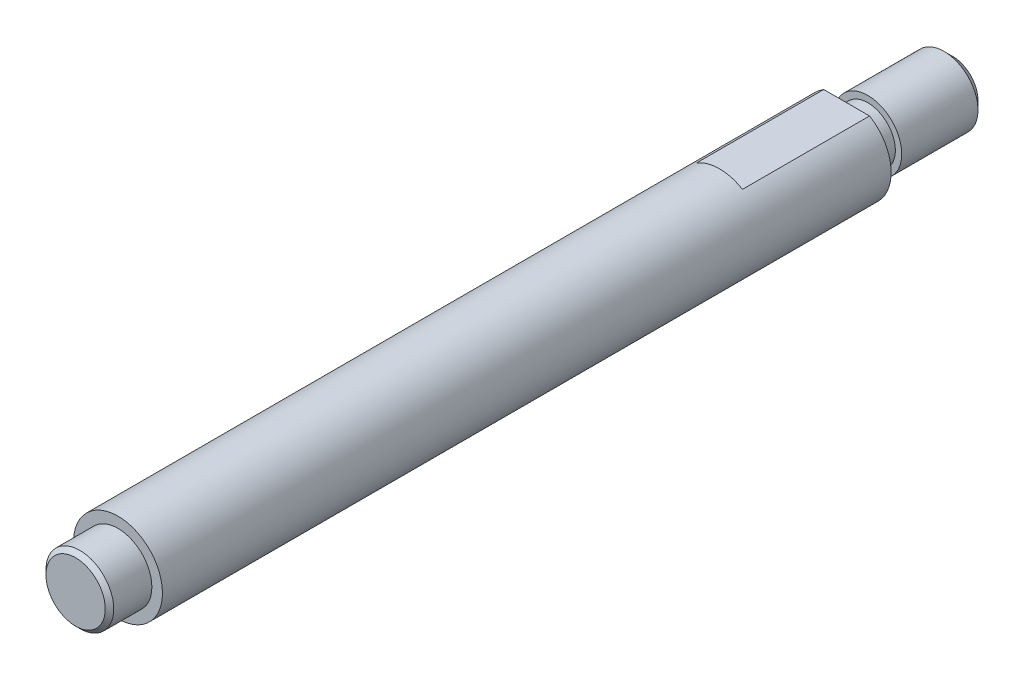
ISO-10303-21;
HEADER;
FILE_DESCRIPTION(('STEP AP214'),'2;1');
FILE_NAME('part.step','',(''),(''),'','','');
FILE_SCHEMA(('AUTOMOTIVE_DESIGN { 1 0 10303 214 1 1 1 1 }'));
ENDSEC;
DATA;
#1=APPLICATION_CONTEXT('core data for automotive mechanical design processes');
#2=APPLICATION_PROTOCOL_DEFINITION('international standard','automotive_design',2000,#1);
#3=PRODUCT_CONTEXT('',#1,'mechanical');
#4=PRODUCT('Part','Part','',(#3));
#5=PRODUCT_RELATED_PRODUCT_CATEGORY('part','',(#4));
#6=PRODUCT_DEFINITION_FORMATION('','',#4);
#7=PRODUCT_DEFINITION_CONTEXT('part definition',#1,'design');
#8=PRODUCT_DEFINITION('design','',#6,#7);
#9=PRODUCT_DEFINITION_SHAPE('','',#8);
#10=(LENGTH_UNIT() NAMED_UNIT(*) SI_UNIT(.MILLI.,.METRE.));
#11=(NAMED_UNIT(*) PLANE_ANGLE_UNIT() SI_UNIT($,.RADIAN.));
#12=(NAMED_UNIT(*) SI_UNIT($,.STERADIAN.) SOLID_ANGLE_UNIT());
#13=UNCERTAINTY_MEASURE_WITH_UNIT(LENGTH_MEASURE(1.E-05),#10,'distance_accuracy_value','');
#14=(GEOMETRIC_REPRESENTATION_CONTEXT(3) GLOBAL_UNCERTAINTY_ASSIGNED_CONTEXT((#13)) GLOBAL_UNIT_ASSIGNED_CONTEXT((#10,
#11,#12)) REPRESENTATION_CONTEXT('',''));
#15=CARTESIAN_POINT('',(0.,0.,0.));
#16=DIRECTION('',(0.,0.,1.));
#17=DIRECTION('',(1.,0.,0.));
#18=AXIS2_PLACEMENT_3D('',#15,#16,#17);
#19=CARTESIAN_POINT('',(0.,0.,0.));
#20=DIRECTION('',(0.,0.,1.));
#21=DIRECTION('',(1.,0.,0.));
#22=AXIS2_PLACEMENT_3D('',#19,#20,#21);
#23=PLANE('',#22);
#24=CARTESIAN_POINT('',(0.,0.,0.));
#25=DIRECTION('',(0.,0.,1.));
#26=DIRECTION('',(1.,0.,0.));
#27=AXIS2_PLACEMENT_3D('',#24,#25,#26);
#28=CIRCLE('',#27,3.25);
#29=CARTESIAN_POINT('',(3.25,0.,0.));
#30=VERTEX_POINT('',#29);
#31=EDGE_CURVE('E99',#30,#30,#28,.F.);
#32=ORIENTED_EDGE('',*,*,#31,.F.);
#33=EDGE_LOOP('',(#32));
#34=FACE_BOUND('',#33,.T.);
#35=CARTESIAN_POINT('',(0.,0.,0.));
#36=DIRECTION('',(0.,0.,1.));
#37=DIRECTION('',(1.,0.,0.));
#38=AXIS2_PLACEMENT_3D('',#35,#36,#37);
#39=CIRCLE('',#38,5.25);
#40=CARTESIAN_POINT('',(2.70416345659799,-4.5,0.));
#41=VERTEX_POINT('',#40);
#42=CARTESIAN_POINT('',(2.70416345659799,4.5,0.));
#43=VERTEX_POINT('',#42);
#44=EDGE_CURVE('E88',#41,#43,#39,.T.);
#45=ORIENTED_EDGE('',*,*,#44,.F.);
#46=DIRECTION('',(-1.,0.,0.));
#47=VECTOR('',#46,1.);
#48=CARTESIAN_POINT('',(2.70416345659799,-4.5,0.));
#49=LINE('',#48,#47);
#50=CARTESIAN_POINT('',(-2.70416345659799,-4.5,0.));
#51=VERTEX_POINT('',#50);
#52=EDGE_CURVE('E74',#41,#51,#49,.T.);
#53=ORIENTED_EDGE('',*,*,#52,.T.);
#54=CARTESIAN_POINT('',(-2.70416345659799,4.5,0.));
#55=VERTEX_POINT('',#54);
#56=EDGE_CURVE('E90',#55,#51,#39,.T.);
#57=ORIENTED_EDGE('',*,*,#56,.F.);
#58=DIRECTION('',(-1.,0.,0.));
#59=VECTOR('',#58,1.);
#60=CARTESIAN_POINT('',(-23.8184183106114,4.5,0.));
#61=LINE('',#60,#59);
#62=EDGE_CURVE('E57',#43,#55,#61,.T.);
#63=ORIENTED_EDGE('',*,*,#62,.F.);
#64=EDGE_LOOP('',(#45,#53,#57,#63));
#65=FACE_BOUND('',#64,.T.);
#66=ADVANCED_FACE('F34',(#34,#65),#23,.F.);
#67=CARTESIAN_POINT('',(0.,0.,86.));
#68=DIRECTION('',(0.,0.,-1.));
#69=DIRECTION('',(-1.,0.,0.));
#70=AXIS2_PLACEMENT_3D('',#67,#68,#69);
#71=CYLINDRICAL_SURFACE('',#70,5.25);
#72=CARTESIAN_POINT('',(0.,0.,86.));
#73=DIRECTION('',(0.,0.,1.));
#74=DIRECTION('',(1.,0.,0.));
#75=AXIS2_PLACEMENT_3D('',#72,#73,#74);
#76=CIRCLE('',#75,5.25);
#77=CARTESIAN_POINT('',(5.25,0.,86.));
#78=VERTEX_POINT('',#77);
#79=EDGE_CURVE('E93',#78,#78,#76,.T.);
#80=ORIENTED_EDGE('',*,*,#79,.F.);
#81=EDGE_LOOP('',(#80));
#82=FACE_BOUND('',#81,.T.);
#83=CARTESIAN_POINT('',(0.,0.,15.));
#84=DIRECTION('',(0.,0.,1.));
#85=DIRECTION('',(1.,0.,0.));
#86=AXIS2_PLACEMENT_3D('',#83,#84,#85);
#87=CIRCLE('',#86,5.25);
#88=CARTESIAN_POINT('',(-2.70416345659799,-4.5,15.));
#89=VERTEX_POINT('',#88);
#90=CARTESIAN_POINT('',(2.70416345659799,-4.5,15.));
#91=VERTEX_POINT('',#90);
#92=EDGE_CURVE('E11',#89,#91,#87,.T.);
#93=ORIENTED_EDGE('',*,*,#92,.T.);
#94=DIRECTION('',(0.,0.,-1.));
#95=VECTOR('',#94,1.);
#96=CARTESIAN_POINT('',(2.70416345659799,-4.5,15.));
#97=LINE('',#96,#95);
#98=EDGE_CURVE('E77',#91,#41,#97,.T.);
#99=ORIENTED_EDGE('',*,*,#98,.T.);
#100=ORIENTED_EDGE('',*,*,#44,.T.);
#101=DIRECTION('',(0.,0.,-1.));
#102=VECTOR('',#101,1.);
#103=CARTESIAN_POINT('',(2.70416345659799,4.5,86.));
#104=LINE('',#103,#102);
#105=CARTESIAN_POINT('',(2.70416345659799,4.5,15.));
#106=VERTEX_POINT('',#105);
#107=EDGE_CURVE('E42',#106,#43,#104,.T.);
#108=ORIENTED_EDGE('',*,*,#107,.F.);
#109=CARTESIAN_POINT('',(0.,0.,15.));
#110=DIRECTION('',(0.,0.,-1.));
#111=DIRECTION('',(-1.,0.,0.));
#112=AXIS2_PLACEMENT_3D('',#109,#110,#111);
#113=CIRCLE('',#112,5.25);
#114=CARTESIAN_POINT('',(-2.70416345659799,4.5,15.));
#115=VERTEX_POINT('',#114);
#116=EDGE_CURVE('E116',#115,#106,#113,.T.);
#117=ORIENTED_EDGE('',*,*,#116,.F.);
#118=DIRECTION('',(0.,0.,-1.));
#119=VECTOR('',#118,1.);
#120=CARTESIAN_POINT('',(-2.70416345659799,4.5,86.));
#121=LINE('',#120,#119);
#122=EDGE_CURVE('E114',#55,#115,#121,.F.);
#123=ORIENTED_EDGE('',*,*,#122,.F.);
#124=ORIENTED_EDGE('',*,*,#56,.T.);
#125=DIRECTION('',(0.,0.,1.));
#126=VECTOR('',#125,1.);
#127=CARTESIAN_POINT('',(-2.70416345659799,-4.5,15.));
#128=LINE('',#127,#126);
#129=EDGE_CURVE('E79',#51,#89,#128,.T.);
#130=ORIENTED_EDGE('',*,*,#129,.T.);
#131=EDGE_LOOP('',(#93,#99,#100,#108,#117,#123,#124,#130));
#132=FACE_BOUND('',#131,.T.);
#133=ADVANCED_FACE('F86',(#82,#132),#71,.T.);
#134=CARTESIAN_POINT('',(0.,0.,86.));
#135=DIRECTION('',(0.,0.,1.));
#136=DIRECTION('',(1.,0.,0.));
#137=AXIS2_PLACEMENT_3D('',#134,#135,#136);
#138=PLANE('',#137);
#139=ORIENTED_EDGE('',*,*,#79,.T.);
#140=EDGE_LOOP('',(#139));
#141=FACE_BOUND('',#140,.T.);
#142=CARTESIAN_POINT('',(0.,0.,86.));
#143=DIRECTION('',(0.,0.,1.));
#144=DIRECTION('',(1.,0.,0.));
#145=AXIS2_PLACEMENT_3D('',#142,#143,#144);
#146=CIRCLE('',#145,4.);
#147=CARTESIAN_POINT('',(4.,0.,86.));
#148=VERTEX_POINT('',#147);
#149=EDGE_CURVE('E91',#148,#148,#146,.T.);
#150=ORIENTED_EDGE('',*,*,#149,.F.);
#151=EDGE_LOOP('',(#150));
#152=FACE_BOUND('',#151,.T.);
#153=ADVANCED_FACE('F149',(#141,#152),#138,.T.);
#154=CARTESIAN_POINT('',(0.,0.,91.));
#155=DIRECTION('',(0.,0.,-1.));
#156=DIRECTION('',(-1.,0.,0.));
#157=AXIS2_PLACEMENT_3D('',#154,#155,#156);
#158=CYLINDRICAL_SURFACE('',#157,4.);
#159=CARTESIAN_POINT('',(0.,0.,90.5));
#160=DIRECTION('',(0.,0.,1.));
#161=DIRECTION('',(1.,0.,0.));
#162=AXIS2_PLACEMENT_3D('',#159,#160,#161);
#163=CIRCLE('',#162,4.);
#164=CARTESIAN_POINT('',(4.,0.,90.5));
#165=VERTEX_POINT('',#164);
#166=EDGE_CURVE('E111',#165,#165,#163,.F.);
#167=ORIENTED_EDGE('',*,*,#166,.T.);
#168=EDGE_LOOP('',(#167));
#169=FACE_BOUND('',#168,.T.);
#170=ORIENTED_EDGE('',*,*,#149,.T.);
#171=EDGE_LOOP('',(#170));
#172=FACE_BOUND('',#171,.T.);
#173=ADVANCED_FACE('F182',(#169,#172),#158,.T.);
#174=CARTESIAN_POINT('',(0.,0.,91.));
#175=DIRECTION('',(0.,0.,1.));
#176=DIRECTION('',(1.,0.,0.));
#177=AXIS2_PLACEMENT_3D('',#174,#175,#176);
#178=PLANE('',#177);
#179=CARTESIAN_POINT('',(0.,0.,91.));
#180=DIRECTION('',(0.,0.,1.));
#181=DIRECTION('',(1.,0.,0.));
#182=AXIS2_PLACEMENT_3D('',#179,#180,#181);
#183=CIRCLE('',#182,3.50000000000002);
#184=CARTESIAN_POINT('',(3.50000000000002,0.,91.));
#185=VERTEX_POINT('',#184);
#186=EDGE_CURVE('E108',#185,#185,#183,.T.);
#187=ORIENTED_EDGE('',*,*,#186,.T.);
#188=EDGE_LOOP('',(#187));
#189=FACE_BOUND('',#188,.T.);
#190=ADVANCED_FACE('F140',(#189),#178,.T.);
#191=CARTESIAN_POINT('',(0.,0.,-2.5));
#192=DIRECTION('',(0.,0.,1.));
#193=DIRECTION('',(1.,0.,0.));
#194=AXIS2_PLACEMENT_3D('',#191,#192,#193);
#195=CYLINDRICAL_SURFACE('',#194,3.25);
#196=CARTESIAN_POINT('',(0.,0.,-2.5));
#197=DIRECTION('',(0.,0.,-1.));
#198=DIRECTION('',(-1.,0.,0.));
#199=AXIS2_PLACEMENT_3D('',#196,#197,#198);
#200=CIRCLE('',#199,3.25);
#201=CARTESIAN_POINT('',(-3.25,0.,-2.5));
#202=VERTEX_POINT('',#201);
#203=EDGE_CURVE('E95',#202,#202,#200,.T.);
#204=ORIENTED_EDGE('',*,*,#203,.F.);
#205=EDGE_LOOP('',(#204));
#206=FACE_BOUND('',#205,.T.);
#207=ORIENTED_EDGE('',*,*,#31,.T.);
#208=EDGE_LOOP('',(#207));
#209=FACE_BOUND('',#208,.T.);
#210=ADVANCED_FACE('F137',(#206,#209),#195,.T.);
#211=CARTESIAN_POINT('',(0.,0.,-2.5));
#212=DIRECTION('',(0.,0.,-1.));
#213=DIRECTION('',(-1.,0.,0.));
#214=AXIS2_PLACEMENT_3D('',#211,#212,#213);
#215=PLANE('',#214);
#216=CARTESIAN_POINT('',(0.,0.,-2.5));
#217=DIRECTION('',(0.,0.,-1.));
#218=DIRECTION('',(-1.,0.,0.));
#219=AXIS2_PLACEMENT_3D('',#216,#217,#218);
#220=CIRCLE('',#219,4.);
#221=CARTESIAN_POINT('',(-4.,0.,-2.5));
#222=VERTEX_POINT('',#221);
#223=EDGE_CURVE('E125',#222,#222,#220,.T.);
#224=ORIENTED_EDGE('',*,*,#223,.F.);
#225=EDGE_LOOP('',(#224));
#226=FACE_BOUND('',#225,.T.);
#227=ORIENTED_EDGE('',*,*,#203,.T.);
#228=EDGE_LOOP('',(#227));
#229=FACE_BOUND('',#228,.T.);
#230=ADVANCED_FACE('F135',(#226,#229),#215,.F.);
#231=CARTESIAN_POINT('',(0.,0.,-12.5));
#232=DIRECTION('',(0.,0.,1.));
#233=DIRECTION('',(1.,0.,0.));
#234=AXIS2_PLACEMENT_3D('',#231,#232,#233);
#235=CYLINDRICAL_SURFACE('',#234,4.);
#236=CARTESIAN_POINT('',(0.,0.,-11.5));
#237=DIRECTION('',(0.,0.,-1.));
#238=DIRECTION('',(-1.,0.,0.));
#239=AXIS2_PLACEMENT_3D('',#236,#237,#238);
#240=CIRCLE('',#239,4.);
#241=CARTESIAN_POINT('',(-4.,0.,-11.5));
#242=VERTEX_POINT('',#241);
#243=EDGE_CURVE('E105',#242,#242,#240,.F.);
#244=ORIENTED_EDGE('',*,*,#243,.T.);
#245=EDGE_LOOP('',(#244));
#246=FACE_BOUND('',#245,.T.);
#247=ORIENTED_EDGE('',*,*,#223,.T.);
#248=EDGE_LOOP('',(#247));
#249=FACE_BOUND('',#248,.T.);
#250=ADVANCED_FACE('F163',(#246,#249),#235,.T.);
#251=CARTESIAN_POINT('',(0.,0.,-12.5));
#252=DIRECTION('',(0.,0.,-1.));
#253=DIRECTION('',(-1.,0.,0.));
#254=AXIS2_PLACEMENT_3D('',#251,#252,#253);
#255=PLANE('',#254);
#256=CARTESIAN_POINT('',(0.,0.,-12.5));
#257=DIRECTION('',(0.,0.,-1.));
#258=DIRECTION('',(-1.,0.,0.));
#259=AXIS2_PLACEMENT_3D('',#256,#257,#258);
#260=CIRCLE('',#259,2.99999999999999);
#261=CARTESIAN_POINT('',(-2.99999999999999,0.,-12.5));
#262=VERTEX_POINT('',#261);
#263=EDGE_CURVE('E102',#262,#262,#260,.T.);
#264=ORIENTED_EDGE('',*,*,#263,.T.);
#265=EDGE_LOOP('',(#264));
#266=FACE_BOUND('',#265,.T.);
#267=ADVANCED_FACE('F156',(#266),#255,.T.);
#268=CARTESIAN_POINT('',(0.,0.,-12.5));
#269=DIRECTION('',(0.,0.,1.));
#270=DIRECTION('',(1.,0.,0.));
#271=AXIS2_PLACEMENT_3D('',#268,#269,#270);
#272=CONICAL_SURFACE('',#271,2.99999999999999,0.785398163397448);
#273=ORIENTED_EDGE('',*,*,#243,.F.);
#274=EDGE_LOOP('',(#273));
#275=FACE_BOUND('',#274,.T.);
#276=ORIENTED_EDGE('',*,*,#263,.F.);
#277=EDGE_LOOP('',(#276));
#278=FACE_BOUND('',#277,.T.);
#279=ADVANCED_FACE('F154',(#275,#278),#272,.T.);
#280=CARTESIAN_POINT('',(0.,0.,91.));
#281=DIRECTION('',(0.,0.,-1.));
#282=DIRECTION('',(-1.,0.,0.));
#283=AXIS2_PLACEMENT_3D('',#280,#281,#282);
#284=CONICAL_SURFACE('',#283,3.50000000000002,0.785398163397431);
#285=ORIENTED_EDGE('',*,*,#166,.F.);
#286=EDGE_LOOP('',(#285));
#287=FACE_BOUND('',#286,.T.);
#288=ORIENTED_EDGE('',*,*,#186,.F.);
#289=EDGE_LOOP('',(#288));
#290=FACE_BOUND('',#289,.T.);
#291=ADVANCED_FACE('F36',(#287,#290),#284,.T.);
#292=CARTESIAN_POINT('',(-23.8184183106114,5.25,15.));
#293=DIRECTION('',(0.,0.,-1.));
#294=DIRECTION('',(-1.,0.,0.));
#295=AXIS2_PLACEMENT_3D('',#292,#293,#294);
#296=PLANE('',#295);
#297=ORIENTED_EDGE('',*,*,#116,.T.);
#298=DIRECTION('',(1.,0.,0.));
#299=VECTOR('',#298,1.);
#300=CARTESIAN_POINT('',(-23.8184183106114,4.5,15.));
#301=LINE('',#300,#299);
#302=EDGE_CURVE('E120',#115,#106,#301,.T.);
#303=ORIENTED_EDGE('',*,*,#302,.F.);
#304=EDGE_LOOP('',(#297,#303));
#305=FACE_BOUND('',#304,.T.);
#306=ADVANCED_FACE('F123',(#305),#296,.T.);
#307=CARTESIAN_POINT('',(-23.8184183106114,4.5,15.));
#308=DIRECTION('',(0.,1.,0.));
#309=DIRECTION('',(0.,0.,1.));
#310=AXIS2_PLACEMENT_3D('',#307,#308,#309);
#311=PLANE('',#310);
#312=ORIENTED_EDGE('',*,*,#107,.T.);
#313=ORIENTED_EDGE('',*,*,#62,.T.);
#314=ORIENTED_EDGE('',*,*,#122,.T.);
#315=ORIENTED_EDGE('',*,*,#302,.T.);
#316=EDGE_LOOP('',(#312,#313,#314,#315));
#317=FACE_BOUND('',#316,.T.);
#318=ADVANCED_FACE('F118',(#317),#311,.T.);
#319=CARTESIAN_POINT('',(2.70416345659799,-5.25,15.));
#320=DIRECTION('',(0.,0.,1.));
#321=DIRECTION('',(1.,0.,0.));
#322=AXIS2_PLACEMENT_3D('',#319,#320,#321);
#323=PLANE('',#322);
#324=DIRECTION('',(1.,0.,0.));
#325=VECTOR('',#324,1.);
#326=CARTESIAN_POINT('',(2.70416345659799,-4.5,15.));
#327=LINE('',#326,#325);
#328=EDGE_CURVE('E49',#89,#91,#327,.T.);
#329=ORIENTED_EDGE('',*,*,#328,.T.);
#330=ORIENTED_EDGE('',*,*,#92,.F.);
#331=EDGE_LOOP('',(#329,#330));
#332=FACE_BOUND('',#331,.T.);
#333=ADVANCED_FACE('F214',(#332),#323,.F.);
#334=CARTESIAN_POINT('',(2.70416345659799,-4.5,0.));
#335=DIRECTION('',(0.,1.,0.));
#336=DIRECTION('',(0.,0.,1.));
#337=AXIS2_PLACEMENT_3D('',#334,#335,#336);
#338=PLANE('',#337);
#339=ORIENTED_EDGE('',*,*,#98,.F.);
#340=ORIENTED_EDGE('',*,*,#328,.F.);
#341=ORIENTED_EDGE('',*,*,#129,.F.);
#342=ORIENTED_EDGE('',*,*,#52,.F.);
#343=EDGE_LOOP('',(#339,#340,#341,#342));
#344=FACE_BOUND('',#343,.T.);
#345=ADVANCED_FACE('F76',(#344),#338,.F.);
#346=CLOSED_SHELL('',(#66,#133,#153,#173,#190,#210,#230,#250,#267,#279,#291,#306,#318,#333,#345));
#347=MANIFOLD_SOLID_BREP('B2',#346);
#348=ADVANCED_BREP_SHAPE_REPRESENTATION('',(#18,#347),#14);
#349=SHAPE_DEFINITION_REPRESENTATION(#9,#348);
ENDSEC;
END-ISO-10303-21;
